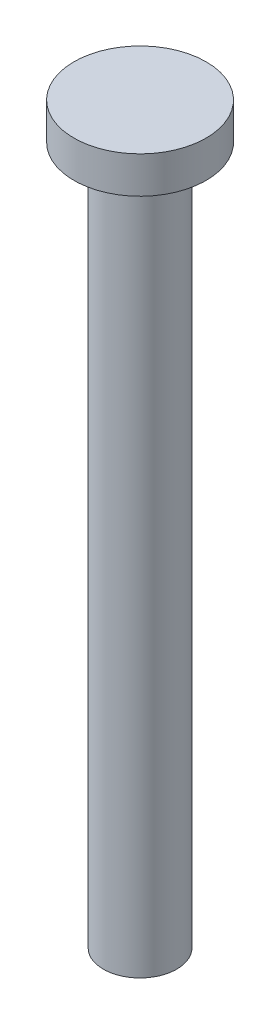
ISO-10303-21;
HEADER;
FILE_DESCRIPTION(('STEP AP214'),'2;1');
FILE_NAME('part.step','',(''),(''),'','','');
FILE_SCHEMA(('AUTOMOTIVE_DESIGN { 1 0 10303 214 1 1 1 1 }'));
ENDSEC;
DATA;
#1=APPLICATION_CONTEXT('core data for automotive mechanical design processes');
#2=APPLICATION_PROTOCOL_DEFINITION('international standard','automotive_design',2000,#1);
#3=PRODUCT_CONTEXT('',#1,'mechanical');
#4=PRODUCT('Part','Part','',(#3));
#5=PRODUCT_RELATED_PRODUCT_CATEGORY('part','',(#4));
#6=PRODUCT_DEFINITION_FORMATION('','',#4);
#7=PRODUCT_DEFINITION_CONTEXT('part definition',#1,'design');
#8=PRODUCT_DEFINITION('design','',#6,#7);
#9=PRODUCT_DEFINITION_SHAPE('','',#8);
#10=(LENGTH_UNIT() NAMED_UNIT(*) SI_UNIT(.MILLI.,.METRE.));
#11=(NAMED_UNIT(*) PLANE_ANGLE_UNIT() SI_UNIT($,.RADIAN.));
#12=(NAMED_UNIT(*) SI_UNIT($,.STERADIAN.) SOLID_ANGLE_UNIT());
#13=UNCERTAINTY_MEASURE_WITH_UNIT(LENGTH_MEASURE(1.E-05),#10,'distance_accuracy_value','');
#14=(GEOMETRIC_REPRESENTATION_CONTEXT(3) GLOBAL_UNCERTAINTY_ASSIGNED_CONTEXT((#13)) GLOBAL_UNIT_ASSIGNED_CONTEXT((#10,
#11,#12)) REPRESENTATION_CONTEXT('',''));
#15=CARTESIAN_POINT('',(0.,0.,0.));
#16=DIRECTION('',(0.,0.,1.));
#17=DIRECTION('',(1.,0.,0.));
#18=AXIS2_PLACEMENT_3D('',#15,#16,#17);
#19=CARTESIAN_POINT('',(0.52,-8.2,65.72108364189));
#20=DIRECTION('',(0.,-1.,0.));
#21=DIRECTION('',(-1.,0.,0.));
#22=AXIS2_PLACEMENT_3D('',#19,#20,#21);
#23=PLANE('',#22);
#24=CARTESIAN_POINT('',(0.,-8.2,65.2));
#25=DIRECTION('',(0.,-1.,0.));
#26=DIRECTION('',(0.,0.,-1.));
#27=AXIS2_PLACEMENT_3D('',#24,#25,#26);
#28=CIRCLE('',#27,0.5);
#29=CARTESIAN_POINT('',(0.,-8.2,64.7));
#30=VERTEX_POINT('',#29);
#31=EDGE_CURVE('E18',#30,#30,#28,.T.);
#32=ORIENTED_EDGE('',*,*,#31,.T.);
#33=EDGE_LOOP('',(#32));
#34=FACE_BOUND('',#33,.T.);
#35=ADVANCED_FACE('F14',(#34),#23,.T.);
#36=CARTESIAN_POINT('',(0.,1.3,65.2));
#37=DIRECTION('',(0.,-1.,0.));
#38=DIRECTION('',(0.,0.,-1.));
#39=AXIS2_PLACEMENT_3D('',#36,#37,#38);
#40=CYLINDRICAL_SURFACE('',#39,0.5);
#41=CARTESIAN_POINT('',(0.,1.3,65.2));
#42=DIRECTION('',(0.,-1.,0.));
#43=DIRECTION('',(0.,0.,-1.));
#44=AXIS2_PLACEMENT_3D('',#41,#42,#43);
#45=CIRCLE('',#44,0.5);
#46=CARTESIAN_POINT('',(0.,1.3,64.7));
#47=VERTEX_POINT('',#46);
#48=EDGE_CURVE('E27',#47,#47,#45,.T.);
#49=ORIENTED_EDGE('',*,*,#48,.T.);
#50=EDGE_LOOP('',(#49));
#51=FACE_BOUND('',#50,.T.);
#52=ORIENTED_EDGE('',*,*,#31,.F.);
#53=EDGE_LOOP('',(#52));
#54=FACE_BOUND('',#53,.T.);
#55=ADVANCED_FACE('F36',(#51,#54),#40,.T.);
#56=CARTESIAN_POINT('',(0.936,1.3,66.13748357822));
#57=DIRECTION('',(0.,-1.,0.));
#58=DIRECTION('',(-1.,0.,0.));
#59=AXIS2_PLACEMENT_3D('',#56,#57,#58);
#60=PLANE('',#59);
#61=ORIENTED_EDGE('',*,*,#48,.F.);
#62=EDGE_LOOP('',(#61));
#63=FACE_BOUND('',#62,.T.);
#64=CARTESIAN_POINT('',(0.,1.3,65.2));
#65=DIRECTION('',(0.,-1.,0.));
#66=DIRECTION('',(0.,0.,-1.));
#67=AXIS2_PLACEMENT_3D('',#64,#65,#66);
#68=CIRCLE('',#67,0.9);
#69=CARTESIAN_POINT('',(0.,1.3,64.3));
#70=VERTEX_POINT('',#69);
#71=EDGE_CURVE('E22',#70,#70,#68,.T.);
#72=ORIENTED_EDGE('',*,*,#71,.T.);
#73=EDGE_LOOP('',(#72));
#74=FACE_BOUND('',#73,.T.);
#75=ADVANCED_FACE('F38',(#63,#74),#60,.T.);
#76=CARTESIAN_POINT('',(0.,1.8,65.2));
#77=DIRECTION('',(0.,-1.,0.));
#78=DIRECTION('',(0.,0.,-1.));
#79=AXIS2_PLACEMENT_3D('',#76,#77,#78);
#80=CYLINDRICAL_SURFACE('',#79,0.9);
#81=ORIENTED_EDGE('',*,*,#71,.F.);
#82=EDGE_LOOP('',(#81));
#83=FACE_BOUND('',#82,.T.);
#84=CARTESIAN_POINT('',(0.,1.8,65.2));
#85=DIRECTION('',(0.,-1.,0.));
#86=DIRECTION('',(0.,0.,-1.));
#87=AXIS2_PLACEMENT_3D('',#84,#85,#86);
#88=CIRCLE('',#87,0.9);
#89=CARTESIAN_POINT('',(0.,1.8,64.3));
#90=VERTEX_POINT('',#89);
#91=EDGE_CURVE('E10',#90,#90,#88,.T.);
#92=ORIENTED_EDGE('',*,*,#91,.T.);
#93=EDGE_LOOP('',(#92));
#94=FACE_BOUND('',#93,.T.);
#95=ADVANCED_FACE('F45',(#83,#94),#80,.T.);
#96=CARTESIAN_POINT('',(0.936,1.8,66.13748357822));
#97=DIRECTION('',(0.,-1.,0.));
#98=DIRECTION('',(-1.,0.,0.));
#99=AXIS2_PLACEMENT_3D('',#96,#97,#98);
#100=PLANE('',#99);
#101=ORIENTED_EDGE('',*,*,#91,.F.);
#102=EDGE_LOOP('',(#101));
#103=FACE_BOUND('',#102,.T.);
#104=ADVANCED_FACE('F16',(#103),#100,.F.);
#105=CLOSED_SHELL('',(#35,#55,#75,#95,#104));
#106=MANIFOLD_SOLID_BREP('B1',#105);
#107=ADVANCED_BREP_SHAPE_REPRESENTATION('',(#18,#106),#14);
#108=SHAPE_DEFINITION_REPRESENTATION(#9,#107);
ENDSEC;
END-ISO-10303-21;
